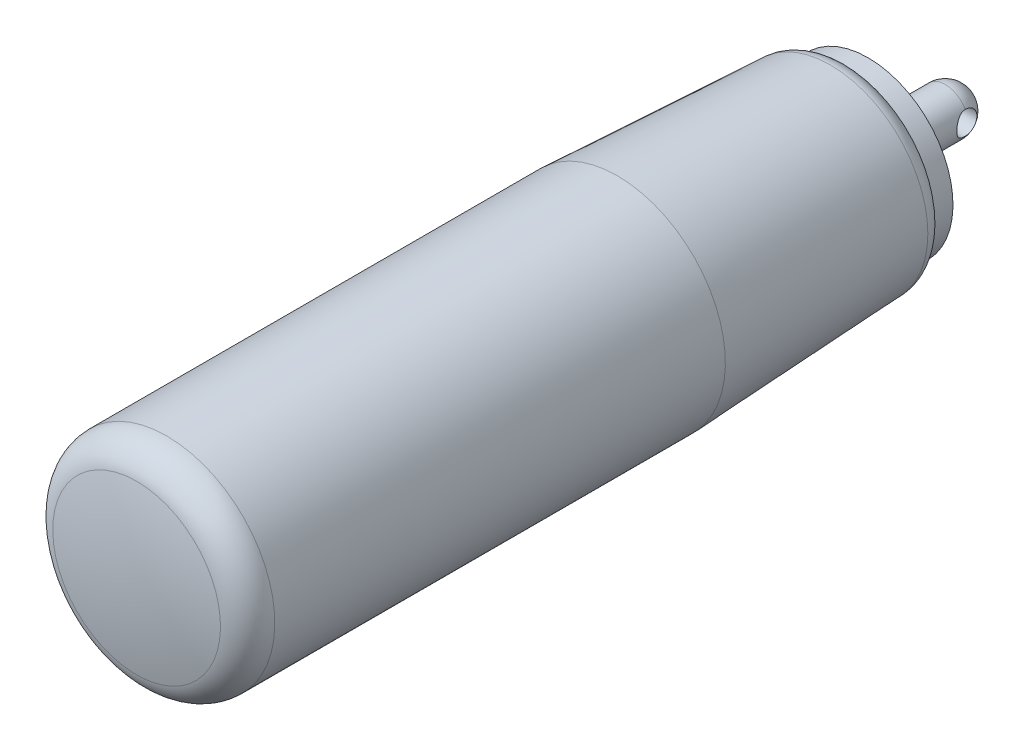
ISO-10303-21;
HEADER;
FILE_DESCRIPTION(('STEP AP214'),'2;1');
FILE_NAME('part.step','',(''),(''),'','','');
FILE_SCHEMA(('AUTOMOTIVE_DESIGN { 1 0 10303 214 1 1 1 1 }'));
ENDSEC;
DATA;
#1=APPLICATION_CONTEXT('core data for automotive mechanical design processes');
#2=APPLICATION_PROTOCOL_DEFINITION('international standard','automotive_design',2000,#1);
#3=PRODUCT_CONTEXT('',#1,'mechanical');
#4=PRODUCT('Part','Part','',(#3));
#5=PRODUCT_RELATED_PRODUCT_CATEGORY('part','',(#4));
#6=PRODUCT_DEFINITION_FORMATION('','',#4);
#7=PRODUCT_DEFINITION_CONTEXT('part definition',#1,'design');
#8=PRODUCT_DEFINITION('design','',#6,#7);
#9=PRODUCT_DEFINITION_SHAPE('','',#8);
#10=(LENGTH_UNIT() NAMED_UNIT(*) SI_UNIT(.MILLI.,.METRE.));
#11=(NAMED_UNIT(*) PLANE_ANGLE_UNIT() SI_UNIT($,.RADIAN.));
#12=(NAMED_UNIT(*) SI_UNIT($,.STERADIAN.) SOLID_ANGLE_UNIT());
#13=UNCERTAINTY_MEASURE_WITH_UNIT(LENGTH_MEASURE(1.E-05),#10,'distance_accuracy_value','');
#14=(GEOMETRIC_REPRESENTATION_CONTEXT(3) GLOBAL_UNCERTAINTY_ASSIGNED_CONTEXT((#13)) GLOBAL_UNIT_ASSIGNED_CONTEXT((#10,
#11,#12)) REPRESENTATION_CONTEXT('',''));
#15=CARTESIAN_POINT('',(0.,0.,0.));
#16=DIRECTION('',(0.,0.,1.));
#17=DIRECTION('',(1.,0.,0.));
#18=AXIS2_PLACEMENT_3D('',#15,#16,#17);
#19=CARTESIAN_POINT('',(0.,0.,14.8751559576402));
#20=DIRECTION('',(0.,0.,1.));
#21=DIRECTION('',(0.,-1.,0.));
#22=AXIS2_PLACEMENT_3D('',#19,#20,#21);
#23=CONICAL_SURFACE('',#22,12.6187577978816,0.0499583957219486);
#24=CARTESIAN_POINT('',(0.,0.,42.4999999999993));
#25=DIRECTION('',(0.,0.,-1.));
#26=DIRECTION('',(0.,1.,0.));
#27=AXIS2_PLACEMENT_3D('',#24,#25,#26);
#28=CIRCLE('',#27,13.9999999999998);
#29=CARTESIAN_POINT('',(0.,13.9999999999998,42.4999999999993));
#30=VERTEX_POINT('',#29);
#31=EDGE_CURVE('E48',#30,#30,#28,.T.);
#32=ORIENTED_EDGE('',*,*,#31,.T.);
#33=EDGE_LOOP('',(#32));
#34=FACE_BOUND('',#33,.T.);
#35=CARTESIAN_POINT('',(0.,0.,14.8751559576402));
#36=DIRECTION('',(0.,0.,-1.));
#37=DIRECTION('',(0.,1.,0.));
#38=AXIS2_PLACEMENT_3D('',#35,#36,#37);
#39=CIRCLE('',#38,12.6187577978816);
#40=CARTESIAN_POINT('',(0.,12.6187577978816,14.8751559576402));
#41=VERTEX_POINT('',#40);
#42=EDGE_CURVE('E109',#41,#41,#39,.T.);
#43=ORIENTED_EDGE('',*,*,#42,.F.);
#44=EDGE_LOOP('',(#43));
#45=FACE_BOUND('',#44,.T.);
#46=ADVANCED_FACE('F14',(#34,#45),#23,.T.);
#47=CARTESIAN_POINT('',(0.,0.,-3.));
#48=DIRECTION('',(0.,0.,-1.));
#49=DIRECTION('',(0.,1.,0.));
#50=AXIS2_PLACEMENT_3D('',#47,#48,#49);
#51=CYLINDRICAL_SURFACE('',#50,13.9999999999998);
#52=ORIENTED_EDGE('',*,*,#31,.F.);
#53=EDGE_LOOP('',(#52));
#54=FACE_BOUND('',#53,.T.);
#55=CARTESIAN_POINT('',(0.,0.,100.899888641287));
#56=DIRECTION('',(0.,0.,-1.));
#57=DIRECTION('',(0.,1.,0.));
#58=AXIS2_PLACEMENT_3D('',#55,#56,#57);
#59=CIRCLE('',#58,13.9999999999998);
#60=CARTESIAN_POINT('',(0.,13.9999999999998,100.899888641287));
#61=VERTEX_POINT('',#60);
#62=EDGE_CURVE('E60',#61,#61,#59,.T.);
#63=ORIENTED_EDGE('',*,*,#62,.T.);
#64=EDGE_LOOP('',(#63));
#65=FACE_BOUND('',#64,.T.);
#66=ADVANCED_FACE('F97',(#54,#65),#51,.T.);
#67=CARTESIAN_POINT('',(0.,0.,100.899888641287));
#68=DIRECTION('',(0.,0.,-1.));
#69=DIRECTION('',(0.,1.,0.));
#70=AXIS2_PLACEMENT_3D('',#67,#68,#69);
#71=TOROIDAL_SURFACE('',#70,9.99999999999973,4.);
#72=CARTESIAN_POINT('',(0.,0.,104.804226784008));
#73=DIRECTION('',(0.,0.,-1.));
#74=DIRECTION('',(0.,1.,0.));
#75=AXIS2_PLACEMENT_3D('',#72,#73,#74);
#76=CIRCLE('',#75,10.869565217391);
#77=CARTESIAN_POINT('',(0.,10.869565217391,104.804226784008));
#78=VERTEX_POINT('',#77);
#79=EDGE_CURVE('E57',#78,#78,#76,.T.);
#80=ORIENTED_EDGE('',*,*,#79,.T.);
#81=EDGE_LOOP('',(#80));
#82=FACE_BOUND('',#81,.T.);
#83=ORIENTED_EDGE('',*,*,#62,.F.);
#84=EDGE_LOOP('',(#83));
#85=FACE_BOUND('',#84,.T.);
#86=ADVANCED_FACE('F103',(#82,#85),#71,.T.);
#87=CARTESIAN_POINT('',(0.,0.,56.));
#88=DIRECTION('',(0.,1.,0.));
#89=DIRECTION('',(1.,0.,0.));
#90=AXIS2_PLACEMENT_3D('',#87,#88,#89);
#91=SPHERICAL_SURFACE('',#90,50.);
#92=CARTESIAN_POINT('',(0.,0.,56.));
#93=DIRECTION('',(0.,0.,-1.));
#94=DIRECTION('',(0.,1.,0.));
#95=AXIS2_PLACEMENT_3D('',#92,#93,#94);
#96=SPHERICAL_SURFACE('',#95,50.);
#97=ORIENTED_EDGE('',*,*,#79,.F.);
#98=EDGE_LOOP('',(#97));
#99=FACE_BOUND('',#98,.T.);
#100=ADVANCED_FACE('F126',(#99),#96,.T.);
#101=CARTESIAN_POINT('',(0.,0.,0.));
#102=DIRECTION('',(0.,1.,0.));
#103=DIRECTION('',(1.,0.,0.));
#104=AXIS2_PLACEMENT_3D('',#101,#102,#103);
#105=SPHERICAL_SURFACE('',#104,3.);
#106=CARTESIAN_POINT('',(2.59807621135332,0.,0.));
#107=DIRECTION('',(-1.,0.,0.));
#108=DIRECTION('',(0.,1.,0.));
#109=AXIS2_PLACEMENT_3D('',#106,#107,#108);
#110=CIRCLE('',#109,1.5);
#111=CARTESIAN_POINT('',(2.59807621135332,-1.5,0.));
#112=VERTEX_POINT('',#111);
#113=CARTESIAN_POINT('',(2.59807621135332,1.5,0.));
#114=VERTEX_POINT('',#113);
#115=EDGE_CURVE('E38',#112,#114,#110,.F.);
#116=ORIENTED_EDGE('',*,*,#115,.F.);
#117=CARTESIAN_POINT('',(0.,0.,0.));
#118=DIRECTION('',(0.,0.,-1.));
#119=DIRECTION('',(0.,1.,0.));
#120=AXIS2_PLACEMENT_3D('',#117,#118,#119);
#121=CIRCLE('',#120,3.);
#122=CARTESIAN_POINT('',(-2.59807621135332,-1.5,0.));
#123=VERTEX_POINT('',#122);
#124=EDGE_CURVE('E52',#112,#123,#121,.T.);
#125=ORIENTED_EDGE('',*,*,#124,.T.);
#126=CARTESIAN_POINT('',(-2.59807621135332,0.,0.));
#127=DIRECTION('',(1.,0.,0.));
#128=DIRECTION('',(0.,-1.,0.));
#129=AXIS2_PLACEMENT_3D('',#126,#127,#128);
#130=CIRCLE('',#129,1.5);
#131=CARTESIAN_POINT('',(-2.59807621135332,1.5,0.));
#132=VERTEX_POINT('',#131);
#133=EDGE_CURVE('E31',#132,#123,#130,.F.);
#134=ORIENTED_EDGE('',*,*,#133,.F.);
#135=EDGE_CURVE('E53',#132,#114,#121,.T.);
#136=ORIENTED_EDGE('',*,*,#135,.T.);
#137=EDGE_LOOP('',(#116,#125,#134,#136));
#138=FACE_BOUND('',#137,.T.);
#139=ADVANCED_FACE('F51',(#138),#105,.T.);
#140=CARTESIAN_POINT('',(0.,0.,-3.));
#141=DIRECTION('',(0.,0.,-1.));
#142=DIRECTION('',(0.,1.,0.));
#143=AXIS2_PLACEMENT_3D('',#140,#141,#142);
#144=CYLINDRICAL_SURFACE('',#143,3.);
#145=CARTESIAN_POINT('',(-2.59807621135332,-1.5,0.));
#146=CARTESIAN_POINT('',(-2.59808302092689,-1.4999945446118,0.0781617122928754));
#147=CARTESIAN_POINT('',(-2.60165701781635,-1.49384995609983,0.156422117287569));
#148=CARTESIAN_POINT('',(-2.61543549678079,-1.46958481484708,0.31054089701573));
#149=CARTESIAN_POINT('',(-2.62565391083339,-1.45143909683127,0.386393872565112));
#150=CARTESIAN_POINT('',(-2.65124019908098,-1.40414992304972,0.533177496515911));
#151=CARTESIAN_POINT('',(-2.66658065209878,-1.3750649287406,0.604131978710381));
#152=CARTESIAN_POINT('',(-2.70063997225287,-1.30690128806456,0.74013630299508));
#153=CARTESIAN_POINT('',(-2.71935902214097,-1.26782210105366,0.805185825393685));
#154=CARTESIAN_POINT('',(-2.75995303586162,-1.17699981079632,0.933458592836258));
#155=CARTESIAN_POINT('',(-2.7819609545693,-1.12447805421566,0.996088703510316));
#156=CARTESIAN_POINT('',(-2.82557974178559,-1.0098807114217,1.11211258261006));
#157=CARTESIAN_POINT('',(-2.84719040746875,-0.947800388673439,1.16550174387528));
#158=CARTESIAN_POINT('',(-2.88932215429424,-0.810734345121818,1.26505072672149));
#159=CARTESIAN_POINT('',(-2.90967159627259,-0.735160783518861,1.3104806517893));
#160=CARTESIAN_POINT('',(-2.94526134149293,-0.576235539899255,1.38771127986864));
#161=CARTESIAN_POINT('',(-2.96050486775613,-0.492888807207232,1.41952058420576));
#162=CARTESIAN_POINT('',(-2.98320691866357,-0.327067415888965,1.46625699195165));
#163=CARTESIAN_POINT('',(-2.99114220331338,-0.244952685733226,1.4822242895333));
#164=CARTESIAN_POINT('',(-3.000113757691,-0.0788559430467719,1.50024917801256));
#165=CARTESIAN_POINT('',(-3.00115420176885,0.005124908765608,1.50231518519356));
#166=CARTESIAN_POINT('',(-2.99644472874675,0.164748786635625,1.49287998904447));
#167=CARTESIAN_POINT('',(-2.99127743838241,0.240481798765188,1.48254297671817));
#168=CARTESIAN_POINT('',(-2.97561367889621,0.388970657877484,1.45067873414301));
#169=CARTESIAN_POINT('',(-2.96511681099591,0.461726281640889,1.42915066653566));
#170=CARTESIAN_POINT('',(-2.93957374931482,0.603464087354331,1.37537615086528));
#171=CARTESIAN_POINT('',(-2.92446662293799,0.672380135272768,1.3429855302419));
#172=CARTESIAN_POINT('',(-2.89106468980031,0.803965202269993,1.26860487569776));
#173=CARTESIAN_POINT('',(-2.87276874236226,0.866631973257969,1.22661140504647));
#174=CARTESIAN_POINT('',(-2.83266591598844,0.990260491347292,1.12965697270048));
#175=CARTESIAN_POINT('',(-2.81069063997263,1.05050111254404,1.07384545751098));
#176=CARTESIAN_POINT('',(-2.76681510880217,1.16115655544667,0.953115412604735));
#177=CARTESIAN_POINT('',(-2.74491492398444,1.21156381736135,0.888189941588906));
#178=CARTESIAN_POINT('',(-2.70216234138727,1.30425800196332,0.746027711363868));
#179=CARTESIAN_POINT('',(-2.68146479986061,1.34582597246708,0.668270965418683));
#180=CARTESIAN_POINT('',(-2.64563175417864,1.41497866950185,0.505593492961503));
#181=CARTESIAN_POINT('',(-2.63049045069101,1.44257798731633,0.420680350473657));
#182=CARTESIAN_POINT('',(-2.60916953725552,1.48077031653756,0.253178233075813));
#183=CARTESIAN_POINT('',(-2.60237483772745,1.49253768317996,0.170938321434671));
#184=CARTESIAN_POINT('',(-2.59676879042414,1.50227541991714,0.00539798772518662));
#185=CARTESIAN_POINT('',(-2.59795180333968,1.50025553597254,-0.077901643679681));
#186=CARTESIAN_POINT('',(-2.60751504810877,1.48355406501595,-0.233480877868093));
#187=CARTESIAN_POINT('',(-2.61509381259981,1.4702817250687,-0.305969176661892));
#188=CARTESIAN_POINT('',(-2.63541032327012,1.43354442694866,-0.447551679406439));
#189=CARTESIAN_POINT('',(-2.64814974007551,1.41007616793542,-0.516644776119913));
#190=CARTESIAN_POINT('',(-2.67804333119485,1.35247138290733,-0.653116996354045));
#191=CARTESIAN_POINT('',(-2.69537464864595,1.31789109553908,-0.720268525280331));
#192=CARTESIAN_POINT('',(-2.73234179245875,1.23943059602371,-0.848203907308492));
#193=CARTESIAN_POINT('',(-2.75197880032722,1.19554560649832,-0.908984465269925));
#194=CARTESIAN_POINT('',(-2.79431997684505,1.09325575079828,-1.03046815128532));
#195=CARTESIAN_POINT('',(-2.81709874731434,1.03371790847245,-1.09019572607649));
#196=CARTESIAN_POINT('',(-2.86101352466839,0.905106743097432,-1.19911835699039));
#197=CARTESIAN_POINT('',(-2.88214897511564,0.83603021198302,-1.24830985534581));
#198=CARTESIAN_POINT('',(-2.92112042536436,0.687803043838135,-1.33586058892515));
#199=CARTESIAN_POINT('',(-2.93885462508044,0.608434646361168,-1.37389967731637));
#200=CARTESIAN_POINT('',(-2.96825032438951,0.443283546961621,-1.43570685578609));
#201=CARTESIAN_POINT('',(-2.9799171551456,0.357506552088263,-1.45948747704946));
#202=CARTESIAN_POINT('',(-2.99501262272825,0.190469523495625,-1.49005284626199));
#203=CARTESIAN_POINT('',(-2.99909891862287,0.109517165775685,-1.49819681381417));
#204=CARTESIAN_POINT('',(-3.00063195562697,-0.0526889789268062,-1.5012648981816));
#205=CARTESIAN_POINT('',(-2.99808102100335,-0.133942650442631,-1.49619364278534));
#206=CARTESIAN_POINT('',(-2.98700953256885,-0.288806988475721,-1.47387538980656));
#207=CARTESIAN_POINT('',(-2.97889342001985,-0.362568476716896,-1.45745272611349));
#208=CARTESIAN_POINT('',(-2.95788140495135,-0.506168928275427,-1.41400950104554));
#209=CARTESIAN_POINT('',(-2.94498481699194,-0.576007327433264,-1.38698741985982));
#210=CARTESIAN_POINT('',(-2.9148889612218,-0.713135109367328,-1.32190942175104));
#211=CARTESIAN_POINT('',(-2.89752925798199,-0.78018771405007,-1.28343101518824));
#212=CARTESIAN_POINT('',(-2.86032199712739,-0.907161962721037,-1.19706310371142));
#213=CARTESIAN_POINT('',(-2.84047329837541,-0.967080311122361,-1.14916927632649));
#214=CARTESIAN_POINT('',(-2.79792915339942,-1.08437100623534,-1.03980429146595));
#215=CARTESIAN_POINT('',(-2.77514698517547,-1.14089652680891,-0.977456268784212));
#216=CARTESIAN_POINT('',(-2.73094614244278,-1.24299493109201,-0.843823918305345));
#217=CARTESIAN_POINT('',(-2.70952868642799,-1.28855812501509,-0.772531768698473));
#218=CARTESIAN_POINT('',(-2.66999407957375,-1.36864661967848,-0.620045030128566));
#219=CARTESIAN_POINT('',(-2.65200261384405,-1.40277759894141,-0.538608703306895));
#220=CARTESIAN_POINT('',(-2.62299234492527,-1.45631806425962,-0.370001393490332));
#221=CARTESIAN_POINT('',(-2.61195024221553,-1.47577678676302,-0.282850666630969));
#222=CARTESIAN_POINT('',(-2.60293908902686,-1.49155051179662,-0.162291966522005));
#223=CARTESIAN_POINT('',(-2.60112193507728,-1.49471415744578,-0.129948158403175));
#224=CARTESIAN_POINT('',(-2.59868903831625,-1.49894010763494,-0.0650752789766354));
#225=CARTESIAN_POINT('',(-2.59807337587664,-1.50000227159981,-0.0325461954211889));
#226=CARTESIAN_POINT('',(-2.59807621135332,-1.5,0.));
#227=B_SPLINE_CURVE_WITH_KNOTS('',3,(#145,#146,#147,#148,#149,#150,#151,#152,#153,#154,#155,
#156,#157,#158,#159,#160,#161,#162,#163,#164,#165,#166,#167,#168,#169,#170,#171,#172,#173,#174,
#175,#176,#177,#178,#179,#180,#181,#182,#183,#184,#185,#186,#187,#188,#189,#190,#191,#192,#193,
#194,#195,#196,#197,#198,#199,#200,#201,#202,#203,#204,#205,#206,#207,#208,#209,#210,#211,#212,
#213,#214,#215,#216,#217,#218,#219,#220,#221,#222,#223,#224,#225,#226),.UNSPECIFIED.,.T.,.F.,(4,
2,2,2,2,2,2,2,2,2,2,2,2,2,2,2,2,2,2,2,2,2,2,2,2,2,2,2,2,2,2,2,2,2,2,2,2,2,2,2,4),(0.,
0.234348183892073,0.469189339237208,0.702792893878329,0.936409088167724,1.18929346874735,
1.44230356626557,1.71236838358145,1.98226240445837,2.23295227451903,2.4834903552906,
2.71224146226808,2.94100968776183,3.1729430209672,3.40495949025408,3.65890787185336,
3.91305072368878,4.18333262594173,4.45333161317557,4.70193436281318,4.9503613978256,
5.17161275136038,5.39293578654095,5.62450944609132,5.85620229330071,6.1171011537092,
6.37808797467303,6.64596272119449,6.91360169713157,7.1566840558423,7.39968130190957,
7.62666637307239,7.85368400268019,8.09041126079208,8.32724745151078,8.58765362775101,
8.84828914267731,9.11716123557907,9.3851269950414,9.48270202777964,9.58028358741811),.UNSPECIFIED.);
#228=EDGE_CURVE('E9',#123,#132,#227,.T.);
#229=ORIENTED_EDGE('',*,*,#228,.F.);
#230=ORIENTED_EDGE('',*,*,#124,.F.);
#231=CARTESIAN_POINT('',(2.59807621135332,-1.5,0.));
#232=CARTESIAN_POINT('',(2.59808302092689,-1.4999945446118,-0.0781617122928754));
#233=CARTESIAN_POINT('',(2.60165701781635,-1.49384995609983,-0.156422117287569));
#234=CARTESIAN_POINT('',(2.61543549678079,-1.46958481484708,-0.31054089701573));
#235=CARTESIAN_POINT('',(2.62565391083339,-1.45143909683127,-0.386393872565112));
#236=CARTESIAN_POINT('',(2.65124019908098,-1.40414992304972,-0.533177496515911));
#237=CARTESIAN_POINT('',(2.66658065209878,-1.3750649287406,-0.604131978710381));
#238=CARTESIAN_POINT('',(2.70063997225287,-1.30690128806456,-0.74013630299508));
#239=CARTESIAN_POINT('',(2.71935902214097,-1.26782210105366,-0.805185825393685));
#240=CARTESIAN_POINT('',(2.75995303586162,-1.17699981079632,-0.933458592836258));
#241=CARTESIAN_POINT('',(2.7819609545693,-1.12447805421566,-0.996088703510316));
#242=CARTESIAN_POINT('',(2.82557974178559,-1.0098807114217,-1.11211258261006));
#243=CARTESIAN_POINT('',(2.84719040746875,-0.947800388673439,-1.16550174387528));
#244=CARTESIAN_POINT('',(2.88932215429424,-0.810734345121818,-1.26505072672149));
#245=CARTESIAN_POINT('',(2.90967159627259,-0.735160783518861,-1.3104806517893));
#246=CARTESIAN_POINT('',(2.94526134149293,-0.576235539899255,-1.38771127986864));
#247=CARTESIAN_POINT('',(2.96050486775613,-0.492888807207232,-1.41952058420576));
#248=CARTESIAN_POINT('',(2.98320691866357,-0.327067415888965,-1.46625699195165));
#249=CARTESIAN_POINT('',(2.99114220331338,-0.244952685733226,-1.4822242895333));
#250=CARTESIAN_POINT('',(3.000113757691,-0.0788559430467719,-1.50024917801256));
#251=CARTESIAN_POINT('',(3.00115420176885,0.005124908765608,-1.50231518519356));
#252=CARTESIAN_POINT('',(2.99644472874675,0.164748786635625,-1.49287998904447));
#253=CARTESIAN_POINT('',(2.99127743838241,0.240481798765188,-1.48254297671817));
#254=CARTESIAN_POINT('',(2.97561367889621,0.388970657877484,-1.45067873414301));
#255=CARTESIAN_POINT('',(2.96511681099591,0.461726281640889,-1.42915066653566));
#256=CARTESIAN_POINT('',(2.93957374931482,0.603464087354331,-1.37537615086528));
#257=CARTESIAN_POINT('',(2.92446662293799,0.672380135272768,-1.3429855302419));
#258=CARTESIAN_POINT('',(2.89106468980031,0.803965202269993,-1.26860487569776));
#259=CARTESIAN_POINT('',(2.87276874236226,0.866631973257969,-1.22661140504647));
#260=CARTESIAN_POINT('',(2.83266591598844,0.990260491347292,-1.12965697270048));
#261=CARTESIAN_POINT('',(2.81069063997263,1.05050111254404,-1.07384545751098));
#262=CARTESIAN_POINT('',(2.76681510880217,1.16115655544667,-0.953115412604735));
#263=CARTESIAN_POINT('',(2.74491492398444,1.21156381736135,-0.888189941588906));
#264=CARTESIAN_POINT('',(2.70216234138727,1.30425800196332,-0.746027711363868));
#265=CARTESIAN_POINT('',(2.68146479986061,1.34582597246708,-0.668270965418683));
#266=CARTESIAN_POINT('',(2.64563175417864,1.41497866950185,-0.505593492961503));
#267=CARTESIAN_POINT('',(2.63049045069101,1.44257798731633,-0.420680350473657));
#268=CARTESIAN_POINT('',(2.60916953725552,1.48077031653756,-0.253178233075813));
#269=CARTESIAN_POINT('',(2.60237483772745,1.49253768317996,-0.170938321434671));
#270=CARTESIAN_POINT('',(2.59676879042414,1.50227541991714,-0.00539798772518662));
#271=CARTESIAN_POINT('',(2.59795180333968,1.50025553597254,0.077901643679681));
#272=CARTESIAN_POINT('',(2.60751504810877,1.48355406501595,0.233480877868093));
#273=CARTESIAN_POINT('',(2.61509381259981,1.4702817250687,0.305969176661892));
#274=CARTESIAN_POINT('',(2.63541032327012,1.43354442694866,0.447551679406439));
#275=CARTESIAN_POINT('',(2.64814974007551,1.41007616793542,0.516644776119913));
#276=CARTESIAN_POINT('',(2.67804333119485,1.35247138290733,0.653116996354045));
#277=CARTESIAN_POINT('',(2.69537464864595,1.31789109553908,0.720268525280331));
#278=CARTESIAN_POINT('',(2.73234179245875,1.23943059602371,0.848203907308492));
#279=CARTESIAN_POINT('',(2.75197880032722,1.19554560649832,0.908984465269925));
#280=CARTESIAN_POINT('',(2.79431997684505,1.09325575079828,1.03046815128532));
#281=CARTESIAN_POINT('',(2.81709874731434,1.03371790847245,1.09019572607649));
#282=CARTESIAN_POINT('',(2.86101352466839,0.905106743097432,1.19911835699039));
#283=CARTESIAN_POINT('',(2.88214897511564,0.83603021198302,1.24830985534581));
#284=CARTESIAN_POINT('',(2.92112042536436,0.687803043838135,1.33586058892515));
#285=CARTESIAN_POINT('',(2.93885462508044,0.608434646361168,1.37389967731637));
#286=CARTESIAN_POINT('',(2.96825032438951,0.443283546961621,1.43570685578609));
#287=CARTESIAN_POINT('',(2.9799171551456,0.357506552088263,1.45948747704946));
#288=CARTESIAN_POINT('',(2.99501262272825,0.190469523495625,1.49005284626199));
#289=CARTESIAN_POINT('',(2.99909891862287,0.109517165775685,1.49819681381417));
#290=CARTESIAN_POINT('',(3.00063195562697,-0.0526889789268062,1.5012648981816));
#291=CARTESIAN_POINT('',(2.99808102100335,-0.133942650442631,1.49619364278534));
#292=CARTESIAN_POINT('',(2.98700953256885,-0.288806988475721,1.47387538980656));
#293=CARTESIAN_POINT('',(2.97889342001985,-0.362568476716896,1.45745272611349));
#294=CARTESIAN_POINT('',(2.95788140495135,-0.506168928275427,1.41400950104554));
#295=CARTESIAN_POINT('',(2.94498481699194,-0.576007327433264,1.38698741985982));
#296=CARTESIAN_POINT('',(2.9148889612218,-0.713135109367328,1.32190942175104));
#297=CARTESIAN_POINT('',(2.89752925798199,-0.78018771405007,1.28343101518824));
#298=CARTESIAN_POINT('',(2.86032199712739,-0.907161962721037,1.19706310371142));
#299=CARTESIAN_POINT('',(2.84047329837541,-0.967080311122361,1.14916927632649));
#300=CARTESIAN_POINT('',(2.79792915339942,-1.08437100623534,1.03980429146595));
#301=CARTESIAN_POINT('',(2.77514698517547,-1.14089652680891,0.977456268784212));
#302=CARTESIAN_POINT('',(2.73094614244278,-1.24299493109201,0.843823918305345));
#303=CARTESIAN_POINT('',(2.70952868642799,-1.28855812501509,0.772531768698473));
#304=CARTESIAN_POINT('',(2.66999407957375,-1.36864661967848,0.620045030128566));
#305=CARTESIAN_POINT('',(2.65200261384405,-1.40277759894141,0.538608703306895));
#306=CARTESIAN_POINT('',(2.62299234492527,-1.45631806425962,0.370001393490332));
#307=CARTESIAN_POINT('',(2.61195024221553,-1.47577678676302,0.282850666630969));
#308=CARTESIAN_POINT('',(2.60293908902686,-1.49155051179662,0.162291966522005));
#309=CARTESIAN_POINT('',(2.60112193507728,-1.49471415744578,0.129948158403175));
#310=CARTESIAN_POINT('',(2.59868903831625,-1.49894010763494,0.0650752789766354));
#311=CARTESIAN_POINT('',(2.59807337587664,-1.50000227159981,0.0325461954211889));
#312=CARTESIAN_POINT('',(2.59807621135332,-1.5,0.));
#313=B_SPLINE_CURVE_WITH_KNOTS('',3,(#231,#232,#233,#234,#235,#236,#237,#238,#239,#240,#241,
#242,#243,#244,#245,#246,#247,#248,#249,#250,#251,#252,#253,#254,#255,#256,#257,#258,#259,#260,
#261,#262,#263,#264,#265,#266,#267,#268,#269,#270,#271,#272,#273,#274,#275,#276,#277,#278,#279,
#280,#281,#282,#283,#284,#285,#286,#287,#288,#289,#290,#291,#292,#293,#294,#295,#296,#297,#298,
#299,#300,#301,#302,#303,#304,#305,#306,#307,#308,#309,#310,#311,#312),.UNSPECIFIED.,.T.,.F.,(4,
2,2,2,2,2,2,2,2,2,2,2,2,2,2,2,2,2,2,2,2,2,2,2,2,2,2,2,2,2,2,2,2,2,2,2,2,2,2,2,4),(0.,
0.234348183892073,0.469189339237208,0.702792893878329,0.936409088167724,1.18929346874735,
1.44230356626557,1.71236838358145,1.98226240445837,2.23295227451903,2.4834903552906,
2.71224146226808,2.94100968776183,3.1729430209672,3.40495949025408,3.65890787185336,
3.91305072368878,4.18333262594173,4.45333161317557,4.70193436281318,4.9503613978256,
5.17161275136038,5.39293578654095,5.62450944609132,5.85620229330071,6.1171011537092,
6.37808797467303,6.64596272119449,6.91360169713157,7.1566840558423,7.39968130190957,
7.62666637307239,7.85368400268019,8.09041126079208,8.32724745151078,8.58765362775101,
8.84828914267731,9.11716123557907,9.3851269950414,9.48270202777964,9.58028358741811),.UNSPECIFIED.);
#314=EDGE_CURVE('E26',#114,#112,#313,.T.);
#315=ORIENTED_EDGE('',*,*,#314,.F.);
#316=ORIENTED_EDGE('',*,*,#135,.F.);
#317=EDGE_LOOP('',(#229,#230,#315,#316));
#318=FACE_BOUND('',#317,.T.);
#319=CARTESIAN_POINT('',(0.,0.,10.));
#320=DIRECTION('',(0.,0.,-1.));
#321=DIRECTION('',(0.,1.,0.));
#322=AXIS2_PLACEMENT_3D('',#319,#320,#321);
#323=CIRCLE('',#322,3.);
#324=CARTESIAN_POINT('',(0.,3.,10.));
#325=VERTEX_POINT('',#324);
#326=EDGE_CURVE('E62',#325,#325,#323,.T.);
#327=ORIENTED_EDGE('',*,*,#326,.T.);
#328=EDGE_LOOP('',(#327));
#329=FACE_BOUND('',#328,.T.);
#330=ADVANCED_FACE('F55',(#318,#329),#144,.T.);
#331=CARTESIAN_POINT('',(-11.,0.,10.));
#332=DIRECTION('',(0.,0.,1.));
#333=DIRECTION('',(0.,-1.,0.));
#334=AXIS2_PLACEMENT_3D('',#331,#332,#333);
#335=PLANE('',#334);
#336=ORIENTED_EDGE('',*,*,#326,.F.);
#337=EDGE_LOOP('',(#336));
#338=FACE_BOUND('',#337,.T.);
#339=CARTESIAN_POINT('',(0.,0.,10.));
#340=DIRECTION('',(0.,0.,-1.));
#341=DIRECTION('',(0.,1.,0.));
#342=AXIS2_PLACEMENT_3D('',#339,#340,#341);
#343=CIRCLE('',#342,11.);
#344=CARTESIAN_POINT('',(0.,11.,10.));
#345=VERTEX_POINT('',#344);
#346=EDGE_CURVE('E113',#345,#345,#343,.T.);
#347=ORIENTED_EDGE('',*,*,#346,.T.);
#348=EDGE_LOOP('',(#347));
#349=FACE_BOUND('',#348,.T.);
#350=ADVANCED_FACE('F85',(#338,#349),#335,.F.);
#351=CARTESIAN_POINT('',(0.,0.,-3.));
#352=DIRECTION('',(0.,0.,-1.));
#353=DIRECTION('',(0.,1.,0.));
#354=AXIS2_PLACEMENT_3D('',#351,#352,#353);
#355=CYLINDRICAL_SURFACE('',#354,11.);
#356=ORIENTED_EDGE('',*,*,#346,.F.);
#357=EDGE_LOOP('',(#356));
#358=FACE_BOUND('',#357,.T.);
#359=CARTESIAN_POINT('',(0.,0.,12.6592949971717));
#360=DIRECTION('',(0.,0.,-1.));
#361=DIRECTION('',(0.,1.,0.));
#362=AXIS2_PLACEMENT_3D('',#359,#360,#361);
#363=CIRCLE('',#362,11.);
#364=CARTESIAN_POINT('',(0.,11.,12.6592949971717));
#365=VERTEX_POINT('',#364);
#366=EDGE_CURVE('E110',#365,#365,#363,.T.);
#367=ORIENTED_EDGE('',*,*,#366,.T.);
#368=EDGE_LOOP('',(#367));
#369=FACE_BOUND('',#368,.T.);
#370=ADVANCED_FACE('F82',(#358,#369),#355,.T.);
#371=CARTESIAN_POINT('',(0.,0.,15.));
#372=DIRECTION('',(0.,0.,-1.));
#373=DIRECTION('',(0.,1.,0.));
#374=AXIS2_PLACEMENT_3D('',#371,#372,#373);
#375=TOROIDAL_SURFACE('',#374,10.1218769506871,2.5);
#376=ORIENTED_EDGE('',*,*,#42,.T.);
#377=EDGE_LOOP('',(#376));
#378=FACE_BOUND('',#377,.T.);
#379=ORIENTED_EDGE('',*,*,#366,.F.);
#380=EDGE_LOOP('',(#379));
#381=FACE_BOUND('',#380,.T.);
#382=ADVANCED_FACE('F78',(#378,#381),#375,.T.);
#383=CARTESIAN_POINT('',(-5.,0.,0.));
#384=DIRECTION('',(1.,0.,0.));
#385=DIRECTION('',(0.,-1.,0.));
#386=AXIS2_PLACEMENT_3D('',#383,#384,#385);
#387=CYLINDRICAL_SURFACE('',#386,1.5);
#388=ORIENTED_EDGE('',*,*,#133,.T.);
#389=ORIENTED_EDGE('',*,*,#228,.T.);
#390=EDGE_LOOP('',(#388,#389));
#391=FACE_BOUND('',#390,.T.);
#392=ORIENTED_EDGE('',*,*,#115,.T.);
#393=ORIENTED_EDGE('',*,*,#314,.T.);
#394=EDGE_LOOP('',(#392,#393));
#395=FACE_BOUND('',#394,.T.);
#396=ADVANCED_FACE('F43',(#391,#395),#387,.F.);
#397=CLOSED_SHELL('',(#46,#66,#86,#100,#139,#330,#350,#370,#382,#396));
#398=MANIFOLD_SOLID_BREP('B1',#397);
#399=ADVANCED_BREP_SHAPE_REPRESENTATION('',(#18,#398),#14);
#400=SHAPE_DEFINITION_REPRESENTATION(#9,#399);
ENDSEC;
END-ISO-10303-21;
